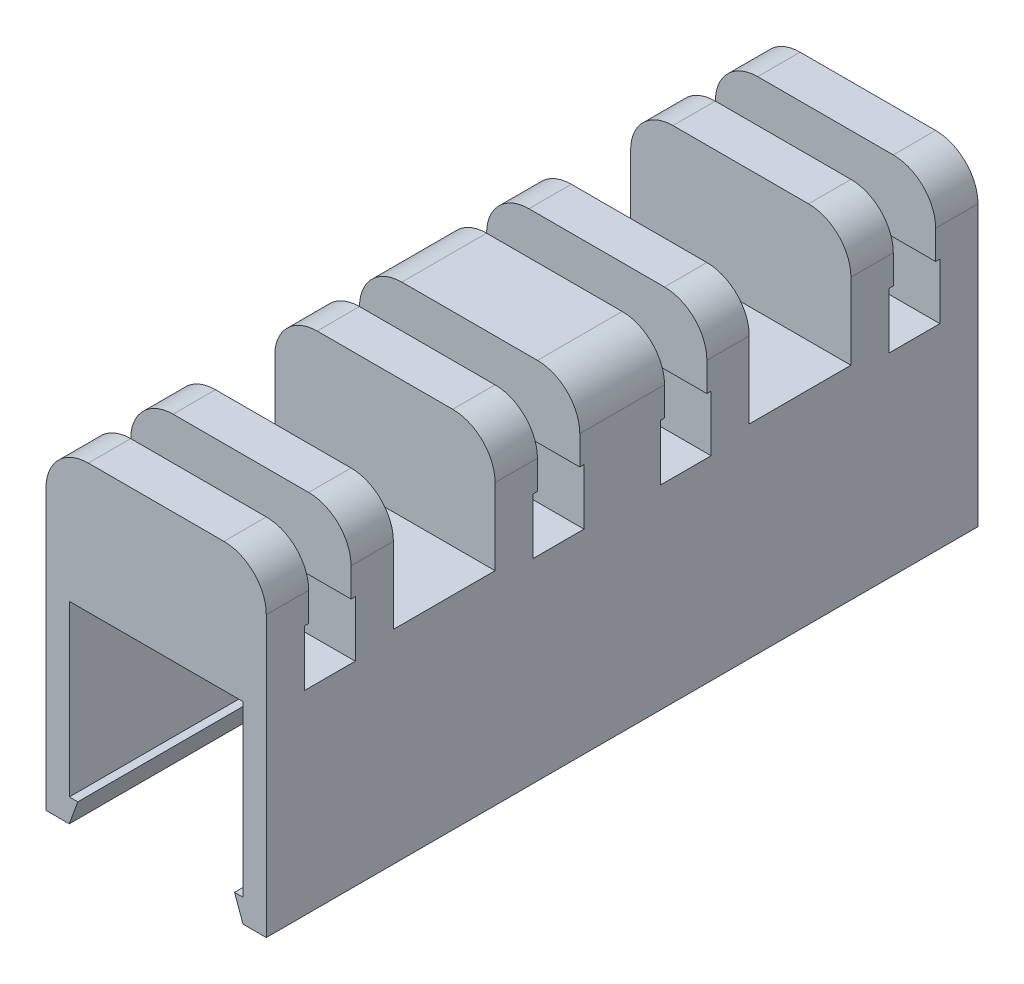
from build123d import *

# Parameters (mm, degrees)
EXTRUSION1_DEPTH        = 84
ENL_V_MAT_EXTRU_1_DEPTH = 91.827102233


with BuildPart() as part:
    # Esquisse1 → Extrusion1 (new body)
    with BuildSketch(Plane.XY):
        with BuildLine():
            Line((-13, -22.75), (-13, 10.25))
            ThreePointArc((-13, 10.25), (-11.535533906, 13.785533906), (-8, 15.25))
            Line((-8, 15.25), (8, 15.25))
            ThreePointArc((8, 15.25), (11.535533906, 13.785533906), (13, 10.25))
            Line((13, 10.25), (13, -22.75))
            Line((13, -22.75), (10.25, -22.75))
            Line((10.25, -22.75), (9.25, -20))
            Line((9.25, -20), (10.25, -20))
            Line((10.25, -20), (10.25, 0))
            Line((10.25, 0), (-10.25, 0))
            Line((-10.25, 0), (-10.25, -20))
            Line((-10.25, -20), (-9.25, -20))
            Line((-9.25, -20), (-10.25, -22.75))
            Line((-10.25, -22.75), (-13, -22.75))
        make_face()
    extrude(amount=EXTRUSION1_DEPTH)

    # Esquisse2 → Enl_v. mat.-Extru.1 (cut, through all)
    with BuildSketch(Plane(origin=(13, 0, 0), x_dir=(0, 0, -1), z_dir=(1, 0, 0))):
        Polygon((-69, 1.25), (-57, 1.25), (-57, 15.25), (-52, 15.25), (-52, 6.853403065), (-52.5, 6.853403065), (-52.5, 0.25), (-46.5, 0.25), (-46.5, 6.853403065), (-47, 6.853403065), (-47, 15.25), (-37, 15.25), (-37, 6.853403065), (-37.5, 6.853403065), (-37.5, 0.25), (-31.5, 0.25), (-31.5, 6.853403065), (-32, 6.853403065), (-32, 15.25), (-27, 15.25), (-27, 1.25), (-15, 1.25), (-15, 15.25), (-10, 15.25), (-10, 6.853403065), (-10.5, 6.853403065), (-10.5, 0.25), (-4.5, 0.25), (-4.5, 6.853403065), (-5, 6.853403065), (-5, 15.25), (0, 15.25), (0, 22.200570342), (-84, 22.200570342), (-84, 15.25), (-79, 15.25), (-79, 6.853403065), (-79.5, 6.853403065), (-79.5, 0.25), (-73.5, 0.25), (-73.5, 6.853403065), (-74, 6.853403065), (-74, 15.25), (-69, 15.25), align=None)
    extrude(amount=-ENL_V_MAT_EXTRU_1_DEPTH, mode=Mode.SUBTRACT)


solid = part.part
